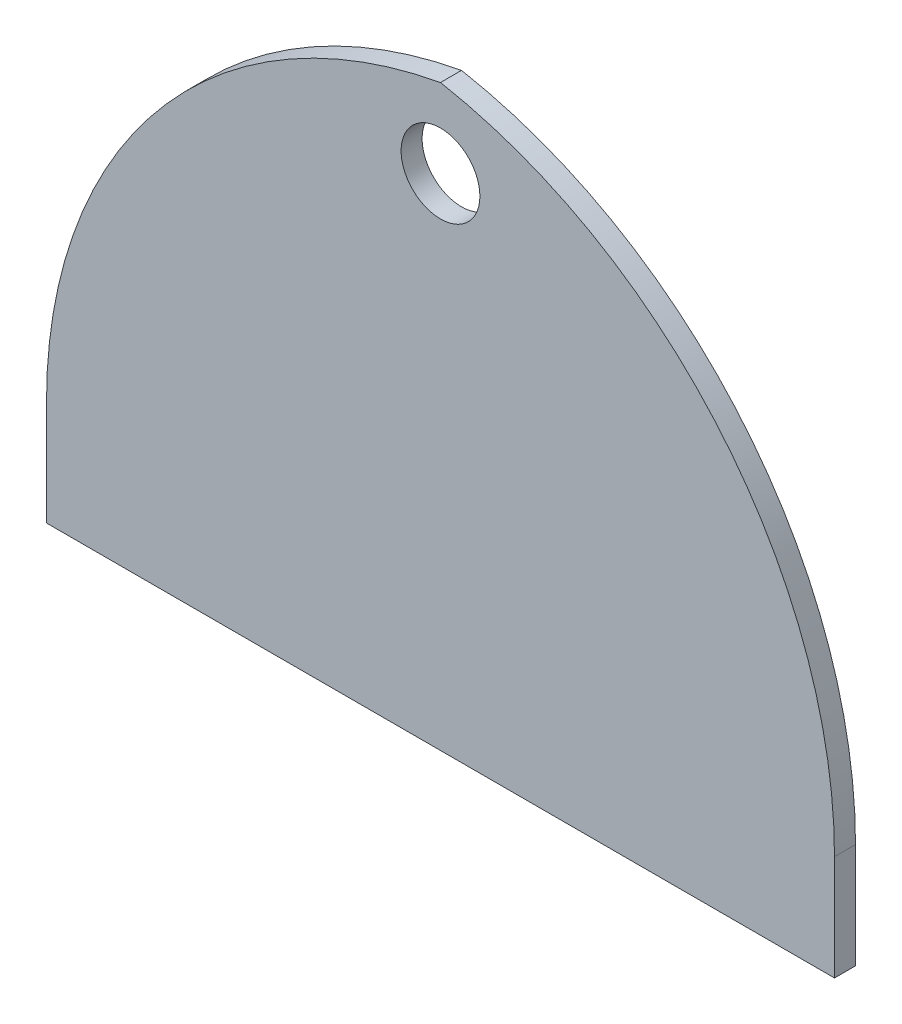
ISO-10303-21;
HEADER;
FILE_DESCRIPTION(('STEP AP214'),'2;1');
FILE_NAME('part.step','',(''),(''),'','','');
FILE_SCHEMA(('AUTOMOTIVE_DESIGN { 1 0 10303 214 1 1 1 1 }'));
ENDSEC;
DATA;
#1=APPLICATION_CONTEXT('core data for automotive mechanical design processes');
#2=APPLICATION_PROTOCOL_DEFINITION('international standard','automotive_design',2000,#1);
#3=PRODUCT_CONTEXT('',#1,'mechanical');
#4=PRODUCT('Part','Part','',(#3));
#5=PRODUCT_RELATED_PRODUCT_CATEGORY('part','',(#4));
#6=PRODUCT_DEFINITION_FORMATION('','',#4);
#7=PRODUCT_DEFINITION_CONTEXT('part definition',#1,'design');
#8=PRODUCT_DEFINITION('design','',#6,#7);
#9=PRODUCT_DEFINITION_SHAPE('','',#8);
#10=(LENGTH_UNIT() NAMED_UNIT(*) SI_UNIT(.MILLI.,.METRE.));
#11=(NAMED_UNIT(*) PLANE_ANGLE_UNIT() SI_UNIT($,.RADIAN.));
#12=(NAMED_UNIT(*) SI_UNIT($,.STERADIAN.) SOLID_ANGLE_UNIT());
#13=UNCERTAINTY_MEASURE_WITH_UNIT(LENGTH_MEASURE(1.E-05),#10,'distance_accuracy_value','');
#14=(GEOMETRIC_REPRESENTATION_CONTEXT(3) GLOBAL_UNCERTAINTY_ASSIGNED_CONTEXT((#13)) GLOBAL_UNIT_ASSIGNED_CONTEXT((#10,
#11,#12)) REPRESENTATION_CONTEXT('',''));
#15=CARTESIAN_POINT('',(0.,0.,0.));
#16=DIRECTION('',(0.,0.,1.));
#17=DIRECTION('',(1.,0.,0.));
#18=AXIS2_PLACEMENT_3D('',#15,#16,#17);
#19=CARTESIAN_POINT('',(351.335117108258,-91.3706169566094,80.));
#20=DIRECTION('',(0.,0.,-1.));
#21=DIRECTION('',(-1.,0.,0.));
#22=AXIS2_PLACEMENT_3D('',#19,#20,#21);
#23=PLANE('',#22);
#24=CARTESIAN_POINT('',(351.335117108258,-91.3706169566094,80.));
#25=DIRECTION('',(0.,0.,1.));
#26=DIRECTION('',(-1.,0.,0.));
#27=AXIS2_PLACEMENT_3D('',#24,#25,#26);
#28=CIRCLE('',#27,1833.03652149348);
#29=CARTESIAN_POINT('',(18.2985956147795,1711.15804147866,80.));
#30=VERTEX_POINT('',#29);
#31=CARTESIAN_POINT('',(-1481.70140438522,-91.3706169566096,80.));
#32=VERTEX_POINT('',#31);
#33=EDGE_CURVE('E116',#30,#32,#28,.T.);
#34=ORIENTED_EDGE('',*,*,#33,.T.);
#35=DIRECTION('',(0.,-1.,0.));
#36=VECTOR('',#35,1.);
#37=CARTESIAN_POINT('',(-1481.70140438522,-491.37061695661,80.));
#38=LINE('',#37,#36);
#39=CARTESIAN_POINT('',(-1481.70140438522,-491.37061695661,80.));
#40=VERTEX_POINT('',#39);
#41=EDGE_CURVE('E83',#32,#40,#38,.T.);
#42=ORIENTED_EDGE('',*,*,#41,.T.);
#43=DIRECTION('',(1.,0.,0.));
#44=VECTOR('',#43,1.);
#45=CARTESIAN_POINT('',(1518.29859561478,-491.370616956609,80.));
#46=LINE('',#45,#44);
#47=CARTESIAN_POINT('',(1518.29859561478,-491.370616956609,80.));
#48=VERTEX_POINT('',#47);
#49=EDGE_CURVE('E87',#40,#48,#46,.T.);
#50=ORIENTED_EDGE('',*,*,#49,.T.);
#51=DIRECTION('',(0.,1.,0.));
#52=VECTOR('',#51,1.);
#53=CARTESIAN_POINT('',(1518.29859561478,-491.370616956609,80.));
#54=LINE('',#53,#52);
#55=CARTESIAN_POINT('',(1518.29859561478,-91.3706169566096,80.));
#56=VERTEX_POINT('',#55);
#57=EDGE_CURVE('E91',#48,#56,#54,.T.);
#58=ORIENTED_EDGE('',*,*,#57,.T.);
#59=CARTESIAN_POINT('',(-314.737925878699,-91.3706169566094,80.));
#60=DIRECTION('',(0.,0.,1.));
#61=DIRECTION('',(1.,0.,0.));
#62=AXIS2_PLACEMENT_3D('',#59,#60,#61);
#63=CIRCLE('',#62,1833.03652149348);
#64=EDGE_CURVE('E49',#56,#30,#63,.T.);
#65=ORIENTED_EDGE('',*,*,#64,.T.);
#66=EDGE_LOOP('',(#34,#42,#50,#58,#65));
#67=FACE_BOUND('',#66,.T.);
#68=CARTESIAN_POINT('',(18.2985956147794,1411.15804147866,80.));
#69=DIRECTION('',(0.,0.,1.));
#70=DIRECTION('',(1.,0.,0.));
#71=AXIS2_PLACEMENT_3D('',#68,#69,#70);
#72=CIRCLE('',#71,150.);
#73=CARTESIAN_POINT('',(168.298595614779,1411.15804147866,80.));
#74=VERTEX_POINT('',#73);
#75=EDGE_CURVE('E111',#74,#74,#72,.T.);
#76=ORIENTED_EDGE('',*,*,#75,.F.);
#77=EDGE_LOOP('',(#76));
#78=FACE_BOUND('',#77,.T.);
#79=ADVANCED_FACE('F32',(#67,#78),#23,.F.);
#80=CARTESIAN_POINT('',(351.335117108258,-91.3706169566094,0.));
#81=DIRECTION('',(0.,0.,-1.));
#82=DIRECTION('',(-1.,0.,0.));
#83=AXIS2_PLACEMENT_3D('',#80,#81,#82);
#84=PLANE('',#83);
#85=CARTESIAN_POINT('',(351.335117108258,-91.3706169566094,0.));
#86=DIRECTION('',(0.,0.,1.));
#87=DIRECTION('',(-1.,0.,0.));
#88=AXIS2_PLACEMENT_3D('',#85,#86,#87);
#89=CIRCLE('',#88,1833.03652149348);
#90=CARTESIAN_POINT('',(18.2985956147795,1711.15804147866,0.));
#91=VERTEX_POINT('',#90);
#92=CARTESIAN_POINT('',(-1481.70140438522,-91.3706169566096,0.));
#93=VERTEX_POINT('',#92);
#94=EDGE_CURVE('E107',#91,#93,#89,.T.);
#95=ORIENTED_EDGE('',*,*,#94,.F.);
#96=CARTESIAN_POINT('',(-314.737925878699,-91.3706169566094,0.));
#97=DIRECTION('',(0.,0.,1.));
#98=DIRECTION('',(1.,0.,0.));
#99=AXIS2_PLACEMENT_3D('',#96,#97,#98);
#100=CIRCLE('',#99,1833.03652149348);
#101=CARTESIAN_POINT('',(1518.29859561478,-91.3706169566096,0.));
#102=VERTEX_POINT('',#101);
#103=EDGE_CURVE('E75',#102,#91,#100,.T.);
#104=ORIENTED_EDGE('',*,*,#103,.F.);
#105=DIRECTION('',(0.,1.,0.));
#106=VECTOR('',#105,1.);
#107=CARTESIAN_POINT('',(1518.29859561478,-491.370616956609,0.));
#108=LINE('',#107,#106);
#109=CARTESIAN_POINT('',(1518.29859561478,-491.370616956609,0.));
#110=VERTEX_POINT('',#109);
#111=EDGE_CURVE('E69',#110,#102,#108,.T.);
#112=ORIENTED_EDGE('',*,*,#111,.F.);
#113=DIRECTION('',(1.,0.,0.));
#114=VECTOR('',#113,1.);
#115=CARTESIAN_POINT('',(1518.29859561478,-491.370616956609,0.));
#116=LINE('',#115,#114);
#117=CARTESIAN_POINT('',(-1481.70140438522,-491.37061695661,0.));
#118=VERTEX_POINT('',#117);
#119=EDGE_CURVE('E98',#118,#110,#116,.T.);
#120=ORIENTED_EDGE('',*,*,#119,.F.);
#121=DIRECTION('',(0.,-1.,0.));
#122=VECTOR('',#121,1.);
#123=CARTESIAN_POINT('',(-1481.70140438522,-491.37061695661,0.));
#124=LINE('',#123,#122);
#125=EDGE_CURVE('E110',#93,#118,#124,.T.);
#126=ORIENTED_EDGE('',*,*,#125,.F.);
#127=EDGE_LOOP('',(#95,#104,#112,#120,#126));
#128=FACE_BOUND('',#127,.T.);
#129=CARTESIAN_POINT('',(18.2985956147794,1411.15804147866,0.));
#130=DIRECTION('',(0.,0.,1.));
#131=DIRECTION('',(1.,0.,0.));
#132=AXIS2_PLACEMENT_3D('',#129,#130,#131);
#133=CIRCLE('',#132,150.);
#134=CARTESIAN_POINT('',(168.298595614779,1411.15804147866,0.));
#135=VERTEX_POINT('',#134);
#136=EDGE_CURVE('E196',#135,#135,#133,.T.);
#137=ORIENTED_EDGE('',*,*,#136,.T.);
#138=EDGE_LOOP('',(#137));
#139=FACE_BOUND('',#138,.T.);
#140=ADVANCED_FACE('F120',(#128,#139),#84,.T.);
#141=CARTESIAN_POINT('',(351.335117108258,-91.3706169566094,80.));
#142=DIRECTION('',(0.,0.,-1.));
#143=DIRECTION('',(-1.,0.,0.));
#144=AXIS2_PLACEMENT_3D('',#141,#142,#143);
#145=CYLINDRICAL_SURFACE('',#144,1833.03652149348);
#146=ORIENTED_EDGE('',*,*,#94,.T.);
#147=DIRECTION('',(0.,0.,-1.));
#148=VECTOR('',#147,1.);
#149=CARTESIAN_POINT('',(-1481.70140438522,-91.3706169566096,80.));
#150=LINE('',#149,#148);
#151=EDGE_CURVE('E11',#32,#93,#150,.T.);
#152=ORIENTED_EDGE('',*,*,#151,.F.);
#153=ORIENTED_EDGE('',*,*,#33,.F.);
#154=DIRECTION('',(0.,0.,-1.));
#155=VECTOR('',#154,1.);
#156=CARTESIAN_POINT('',(18.2985956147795,1711.15804147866,80.));
#157=LINE('',#156,#155);
#158=EDGE_CURVE('E103',#30,#91,#157,.T.);
#159=ORIENTED_EDGE('',*,*,#158,.T.);
#160=EDGE_LOOP('',(#146,#152,#153,#159));
#161=FACE_BOUND('',#160,.T.);
#162=ADVANCED_FACE('F34',(#161),#145,.T.);
#163=CARTESIAN_POINT('',(-1481.70140438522,-491.37061695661,80.));
#164=DIRECTION('',(1.,0.,0.));
#165=DIRECTION('',(0.,0.,-1.));
#166=AXIS2_PLACEMENT_3D('',#163,#164,#165);
#167=PLANE('',#166);
#168=ORIENTED_EDGE('',*,*,#125,.T.);
#169=DIRECTION('',(0.,0.,-1.));
#170=VECTOR('',#169,1.);
#171=CARTESIAN_POINT('',(-1481.70140438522,-491.37061695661,80.));
#172=LINE('',#171,#170);
#173=EDGE_CURVE('E41',#40,#118,#172,.T.);
#174=ORIENTED_EDGE('',*,*,#173,.F.);
#175=ORIENTED_EDGE('',*,*,#41,.F.);
#176=ORIENTED_EDGE('',*,*,#151,.T.);
#177=EDGE_LOOP('',(#168,#174,#175,#176));
#178=FACE_BOUND('',#177,.T.);
#179=ADVANCED_FACE('F145',(#178),#167,.F.);
#180=CARTESIAN_POINT('',(1518.29859561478,-491.370616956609,80.));
#181=DIRECTION('',(0.,1.,0.));
#182=DIRECTION('',(-1.,0.,0.));
#183=AXIS2_PLACEMENT_3D('',#180,#181,#182);
#184=PLANE('',#183);
#185=ORIENTED_EDGE('',*,*,#119,.T.);
#186=DIRECTION('',(0.,0.,-1.));
#187=VECTOR('',#186,1.);
#188=CARTESIAN_POINT('',(1518.29859561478,-491.370616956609,80.));
#189=LINE('',#188,#187);
#190=EDGE_CURVE('E95',#48,#110,#189,.T.);
#191=ORIENTED_EDGE('',*,*,#190,.F.);
#192=ORIENTED_EDGE('',*,*,#49,.F.);
#193=ORIENTED_EDGE('',*,*,#173,.T.);
#194=EDGE_LOOP('',(#185,#191,#192,#193));
#195=FACE_BOUND('',#194,.T.);
#196=ADVANCED_FACE('F96',(#195),#184,.F.);
#197=CARTESIAN_POINT('',(1518.29859561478,-491.370616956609,80.));
#198=DIRECTION('',(-1.,0.,0.));
#199=DIRECTION('',(0.,0.,1.));
#200=AXIS2_PLACEMENT_3D('',#197,#198,#199);
#201=PLANE('',#200);
#202=ORIENTED_EDGE('',*,*,#111,.T.);
#203=DIRECTION('',(0.,0.,-1.));
#204=VECTOR('',#203,1.);
#205=CARTESIAN_POINT('',(1518.29859561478,-91.3706169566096,80.));
#206=LINE('',#205,#204);
#207=EDGE_CURVE('E99',#56,#102,#206,.T.);
#208=ORIENTED_EDGE('',*,*,#207,.F.);
#209=ORIENTED_EDGE('',*,*,#57,.F.);
#210=ORIENTED_EDGE('',*,*,#190,.T.);
#211=EDGE_LOOP('',(#202,#208,#209,#210));
#212=FACE_BOUND('',#211,.T.);
#213=ADVANCED_FACE('F101',(#212),#201,.F.);
#214=CARTESIAN_POINT('',(-314.737925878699,-91.3706169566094,80.));
#215=DIRECTION('',(0.,0.,-1.));
#216=DIRECTION('',(-1.,0.,0.));
#217=AXIS2_PLACEMENT_3D('',#214,#215,#216);
#218=CYLINDRICAL_SURFACE('',#217,1833.03652149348);
#219=ORIENTED_EDGE('',*,*,#103,.T.);
#220=ORIENTED_EDGE('',*,*,#158,.F.);
#221=ORIENTED_EDGE('',*,*,#64,.F.);
#222=ORIENTED_EDGE('',*,*,#207,.T.);
#223=EDGE_LOOP('',(#219,#220,#221,#222));
#224=FACE_BOUND('',#223,.T.);
#225=ADVANCED_FACE('F125',(#224),#218,.T.);
#226=CARTESIAN_POINT('',(18.2985956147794,1411.15804147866,80.));
#227=DIRECTION('',(0.,0.,-1.));
#228=DIRECTION('',(-1.,0.,0.));
#229=AXIS2_PLACEMENT_3D('',#226,#227,#228);
#230=CYLINDRICAL_SURFACE('',#229,150.);
#231=ORIENTED_EDGE('',*,*,#75,.T.);
#232=EDGE_LOOP('',(#231));
#233=FACE_BOUND('',#232,.T.);
#234=ORIENTED_EDGE('',*,*,#136,.F.);
#235=EDGE_LOOP('',(#234));
#236=FACE_BOUND('',#235,.T.);
#237=ADVANCED_FACE('F127',(#233,#236),#230,.F.);
#238=CLOSED_SHELL('',(#79,#140,#162,#179,#196,#213,#225,#237));
#239=MANIFOLD_SOLID_BREP('B2',#238);
#240=ADVANCED_BREP_SHAPE_REPRESENTATION('',(#18,#239),#14);
#241=SHAPE_DEFINITION_REPRESENTATION(#9,#240);
ENDSEC;
END-ISO-10303-21;
